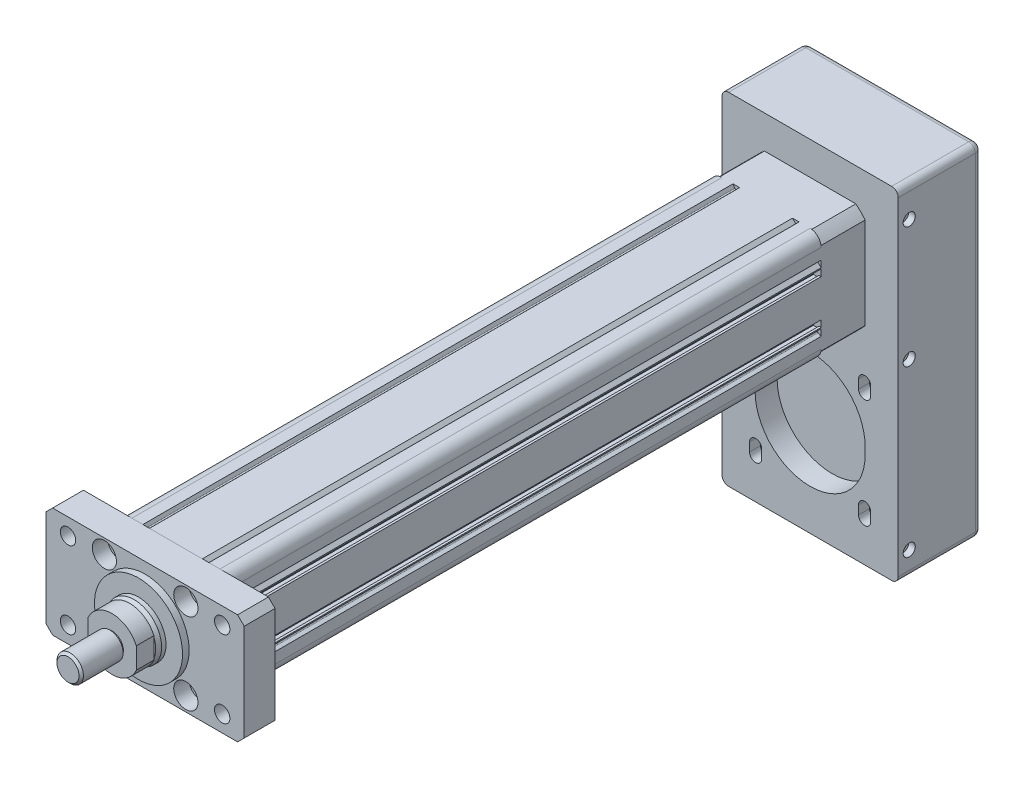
from build123d import *

# Parameters (mm, degrees)
SKETCH_1_R           = 20
SKETCH_1_R_2         = 2.75
EXTRUDE_1_DEPTH      = 268
FILLET_1_R           = 5
EXTRUDE_2_DEPTH      = 14
SKETCH_3_R           = 20
EXTRUDE_3_DEPTH      = 3
SKETCH_5_R           = 12.5
EXTRUDE_4_DEPTH      = 4
CHAMFER_1_SIZE       = 2
CHAMFER_1_SIZE2      = 0.7
EXTRUDE_5_DEPTH      = 8
SKETCH_7_R           = 5.15
EXTRUDE_6_DEPTH      = 1
SKETCH_8_R           = 6
EXTRUDE_7_DEPTH      = 19
CHAMFER_2_SIZE       = 1
SKETCH_23_W          = 50
SKETCH_23_H          = 50
EXTRUDE_8_DEPTH      = 20
SKETCH_24_R          = 42.5
SKETCH_24_R_2        = 32.5
CUT_EXTRUDE_1_DEPTH  = 20
SKETCH_4_R           = 3.5
CUT_EXTRUDE_5_DEPTH  = 30
SKETCH_4_6_R         = 5.5
CUT_EXTRUDE_6_DEPTH  = 7
SKETCH_35_W          = 80
SKETCH_35_H          = 155
EXTRUDE_10_DEPTH     = 38
CUT_EXTRUDE_11_DEPTH = 10
CUT_EXTRUDE_12_DEPTH = 10
CUT_EXTRUDE_START    = 10
CUT_EXTRUDE_13_DEPTH = 5
FILLET_2_R           = 3
SKETCH_37_R          = 2.75
CUT_EXTRUDE_14_DEPTH = 3
CUT_EXTRUDE_START_2  = -3
SKETCH_38_R          = 2.75
CUT_EXTRUDE_15_DEPTH = 3
FILLET_3_R           = 3


with BuildPart() as part:
    # Sketch 1 → Extrude 1 (new body)
    with BuildSketch(Plane.XY):
        with BuildLine():
            Line((-25, 25), (-15, 25))
            Line((-15, 25), (-14.227730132, 23.662389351))
            ThreePointArc((-14.227730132, 23.662389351), (-13.859980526, 23.416666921), (-13.441164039, 23.558835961))
            Line((-13.441164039, 23.558835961), (-12, 25))
            Line((-12, 25), (12, 25))
            Line((12, 25), (13.441164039, 23.558835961))
            ThreePointArc((13.441164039, 23.558835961), (13.859980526, 23.416666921), (14.227730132, 23.662389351))
            Line((14.227730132, 23.662389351), (15, 25))
            Line((15, 25), (25, 25))
            Line((25, 25), (25, 15))
            Line((25, 15), (23.662389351, 14.227730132))
            ThreePointArc((23.662389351, 14.227730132), (23.416666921, 13.859980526), (23.558835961, 13.441164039))
            Line((23.558835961, 13.441164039), (25, 12))
            Line((25, 12), (25, 11.5))
            Line((25, 11.5), (24, 11.5))
            Line((24, 11.5), (24, 12.4))
            Line((24, 12.4), (21.5, 12.4))
            Line((21.5, 12.4), (21.5, 7.6))
            Line((21.5, 7.6), (24, 7.6))
            Line((24, 7.6), (24, 8.5))
            Line((24, 8.5), (25, 8.5))
            Line((25, 8.5), (25, -8.5))
            Line((25, -8.5), (24, -8.5))
            Line((24, -8.5), (24, -7.6))
            Line((24, -7.6), (21.5, -7.6))
            Line((21.5, -7.6), (21.5, -12.4))
            Line((21.5, -12.4), (24, -12.4))
            Line((24, -12.4), (24, -11.5))
            Line((24, -11.5), (25, -11.5))
            Line((25, -11.5), (25, -12))
            Line((25, -12), (23.558835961, -13.441164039))
            ThreePointArc((23.558835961, -13.441164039), (23.416666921, -13.859980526), (23.662389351, -14.227730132))
            Line((23.662389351, -14.227730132), (25, -15))
            Line((25, -15), (25, -25))
            Line((25, -25), (15, -25))
            Line((15, -25), (14.227730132, -23.662389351))
            ThreePointArc((14.227730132, -23.662389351), (13.859980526, -23.416666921), (13.441164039, -23.558835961))
            Line((13.441164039, -23.558835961), (12, -25))
            Line((12, -25), (11.5, -25))
            Line((11.5, -25), (11.5, -24))
            Line((11.5, -24), (12.4, -24))
            Line((12.4, -24), (12.4, -21.5))
            Line((12.4, -21.5), (7.6, -21.5))
            Line((7.6, -21.5), (7.6, -24))
            Line((7.6, -24), (8.5, -24))
            Line((8.5, -24), (8.5, -25))
            Line((8.5, -25), (-8.5, -25))
            Line((-8.5, -25), (-8.5, -24))
            Line((-8.5, -24), (-7.6, -24))
            Line((-7.6, -24), (-7.6, -21.5))
            Line((-7.6, -21.5), (-12.4, -21.5))
            Line((-12.4, -21.5), (-12.4, -24))
            Line((-12.4, -24), (-11.5, -24))
            Line((-11.5, -24), (-11.5, -25))
            Line((-11.5, -25), (-12, -25))
            Line((-12, -25), (-13.441164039, -23.558835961))
            ThreePointArc((-13.441164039, -23.558835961), (-13.859980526, -23.416666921), (-14.227730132, -23.662389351))
            Line((-14.227730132, -23.662389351), (-15, -25))
            Line((-15, -25), (-25, -25))
            Line((-25, -25), (-25, -15))
            Line((-25, -15), (-23.662389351, -14.227730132))
            ThreePointArc((-23.662389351, -14.227730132), (-23.416666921, -13.859980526), (-23.558835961, -13.441164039))
            Line((-23.558835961, -13.441164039), (-25, -12))
            Line((-25, -12), (-25, -11.5))
            Line((-25, -11.5), (-24, -11.5))
            Line((-24, -11.5), (-24, -12.4))
            Line((-24, -12.4), (-21.5, -12.4))
            Line((-21.5, -12.4), (-21.5, -7.6))
            Line((-21.5, -7.6), (-24, -7.6))
            Line((-24, -7.6), (-24, -8.5))
            Line((-24, -8.5), (-25, -8.5))
            Line((-25, -8.5), (-25, 8.5))
            Line((-25, 8.5), (-24, 8.5))
            Line((-24, 8.5), (-24, 7.6))
            Line((-24, 7.6), (-21.5, 7.6))
            Line((-21.5, 7.6), (-21.5, 12.4))
            Line((-21.5, 12.4), (-24, 12.4))
            Line((-24, 12.4), (-24, 11.5))
            Line((-24, 11.5), (-25, 11.5))
            Line((-25, 11.5), (-25, 12))
            Line((-25, 12), (-23.558835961, 13.441164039))
            ThreePointArc((-23.558835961, 13.441164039), (-23.416666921, 13.859980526), (-23.662389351, 14.227730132))
            Line((-23.662389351, 14.227730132), (-25, 15))
            Line((-25, 15), (-25, 25))
        make_face()
        Circle(SKETCH_1_R, mode=Mode.SUBTRACT)
        with Locations((-18.5, 18.5)):
            Circle(SKETCH_1_R_2, mode=Mode.SUBTRACT)
        with Locations((18.5, 18.5)):
            Circle(SKETCH_1_R_2, mode=Mode.SUBTRACT)
        with Locations((18.5, -18.5)):
            Circle(SKETCH_1_R_2, mode=Mode.SUBTRACT)
        with Locations((-18.5, -18.5)):
            Circle(SKETCH_1_R_2, mode=Mode.SUBTRACT)
        with BuildLine():
            Line((-13.868836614, 23), (-5, 23))
            ThreePointArc((-5, 23), (-4.502985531, 22.554558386), (-4.891534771, 22.01190647))
            ThreePointArc((-4.891534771, 22.01190647), (-10.498377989, 19.955831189), (-15.368836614, 16.5))
            Line((-15.368836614, 16.5), (-15.368836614, 21.5))
            Line((-15.368836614, 21.5), (-13.868836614, 23))
        make_face(mode=Mode.SUBTRACT)
        with BuildLine():
            Line((15.368836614, 16.5), (15.368836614, 21.5))
            Line((15.368836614, 21.5), (13.868836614, 23))
            Line((13.868836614, 23), (5, 23))
            ThreePointArc((5, 23), (4.502985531, 22.554558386), (4.891534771, 22.01190647))
            ThreePointArc((4.891534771, 22.01190647), (10.498377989, 19.955831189), (15.368836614, 16.5))
        make_face(mode=Mode.SUBTRACT)
    extrude(amount=EXTRUDE_1_DEPTH)

    # Fillet 1
    fillet_1_edges = [part.edges().sort_by_distance(p)[0] for p in [
        (-25, 25, 134),
        (25, 25, 134),
        (25, -25, 134),
        (-25, -25, 134),
    ]]
    fillet(fillet_1_edges, radius=FILLET_1_R)

    # Sketch 23 → Extrude 8 (add)
    with BuildSketch(Plane(origin=(0, 0, 0), x_dir=(-1, 0, 0), z_dir=(0, 0, -1))):
        Rectangle(SKETCH_23_W, SKETCH_23_H)
    extrude(amount=EXTRUDE_8_DEPTH)

    # Sketch 24 → Cut-Extrude 1 (cut)
    with BuildSketch(Plane(origin=(0, 0, -20), x_dir=(-1, 0, 0), z_dir=(0, 0, -1))):
        Circle(SKETCH_24_R)
        Circle(SKETCH_24_R_2, mode=Mode.SUBTRACT)
    extrude(amount=-CUT_EXTRUDE_1_DEPTH, mode=Mode.SUBTRACT)

    # Sketch 27 → Hole Wizard M6 _1 (revolve, cut)
    with BuildSketch(Plane(origin=(0, -25, -12), x_dir=(0, 0, -1), z_dir=(1, 0, 0))):
        Polygon((0, 0), (0, 8.502151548), (2.5, 7), (2.5, 0), align=None)
    revolve(axis=Axis((0, -31.35, -12), (0, 1, 0)), mode=Mode.SUBTRACT)


with BuildPart() as body_2:
    # Sketch 2 → Extrude 2 (new body)
    with BuildSketch(Plane.XY.offset(268)):
        Polygon((-45, 22), (-42, 25), (42, 25), (45, 22), (45, -22), (42, -25), (-42, -25), (-45, -22), align=None)
    extrude(amount=EXTRUDE_2_DEPTH)


with BuildPart() as body_3:
    # Sketch 3 → Extrude 3 (new body)
    with BuildSketch(Plane.XY.offset(282)):
        Circle(SKETCH_3_R)
    extrude(amount=EXTRUDE_3_DEPTH)


with BuildPart() as body_4:
    # Sketch 5 → Extrude 4 (new body)
    with BuildSketch(Plane.XY.offset(285)):
        Circle(SKETCH_5_R)
    extrude(amount=EXTRUDE_4_DEPTH)

    # Chamfer 1
    chamfer_1_edges = [body_4.edges().sort_by_distance(p)[0] for p in [
        (-12.5, 0, 289),
    ]]
    chamfer_1_side = [body_4.faces().sort_by_distance(p)[0] for p in [
        (-12.5, 0, 287),
    ]]
    chamfer(chamfer_1_edges, length=CHAMFER_1_SIZE, length2=CHAMFER_1_SIZE2, reference=chamfer_1_side[0])


with BuildPart() as body_5:
    # Sketch 6 → Extrude 5 (new body)
    with BuildSketch(Plane.XY.offset(289)):
        with BuildLine():
            Line((-11, 4.795831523), (-11, -4.795831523))
            ThreePointArc((-11, -4.795831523), (0, -12), (11, -4.795831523))
            Line((11, -4.795831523), (11, 4.795831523))
            ThreePointArc((11, 4.795831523), (0, 12), (-11, 4.795831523))
        make_face()
    extrude(amount=EXTRUDE_5_DEPTH)


with BuildPart() as body_6:
    # Sketch 7 → Extrude 6 (new body)
    with BuildSketch(Plane.XY.offset(297)):
        Circle(SKETCH_7_R)
    extrude(amount=EXTRUDE_6_DEPTH)


with BuildPart() as body_7:
    # Sketch 8 → Extrude 7 (new body)
    with BuildSketch(Plane.XY.offset(298)):
        Circle(SKETCH_8_R)
    extrude(amount=EXTRUDE_7_DEPTH)

    # Chamfer 2
    chamfer_2_edges = [body_7.edges().sort_by_distance(p)[0] for p in [
        (-6, 0, 317),
    ]]
    chamfer(chamfer_2_edges, length=CHAMFER_2_SIZE)


with BuildPart() as cut_extrude_5_tool:
    # Sketch 4 → Cut-Extrude 5 (new body)
    with BuildSketch(Plane.XY.offset(282)):
        with Locations((-35, 17.5)):
            Circle(SKETCH_4_R)
        with Locations((-18.5, 18.5)):
            Circle(SKETCH_4_R)
        with Locations(Location((-18.5, -18.5, 0), (0, 0, 180))):
            Circle(SKETCH_4_R)
        with Locations(Location((-35, -17.5, 0), (0, 0, 180))):
            Circle(SKETCH_4_R)
        with Locations((35, -17.5)):
            Circle(SKETCH_4_R)
        with Locations((18.5, -18.5)):
            Circle(SKETCH_4_R)
        with Locations(Location((18.5, 18.5, 0), (0, 0, 180))):
            Circle(SKETCH_4_R)
        with Locations(Location((35, 17.5, 0), (0, 0, 180))):
            Circle(SKETCH_4_R)
    extrude(amount=-CUT_EXTRUDE_5_DEPTH)


with BuildPart() as part_1:
    add(part.part)

    # Cut-Extrude 5: cut by cut_extrude_5_tool
    add(cut_extrude_5_tool.part, mode=Mode.SUBTRACT)

    # Sketch 35 → Extrude 10 (add)
    with BuildSketch(Plane(origin=(0, 0, -20), x_dir=(-1, 0, 0), z_dir=(0, 0, -1))):
        with Locations((0, -37.5)):
            Rectangle(SKETCH_35_W, SKETCH_35_H)
    extrude(amount=EXTRUDE_10_DEPTH)

    # Sketch 35_3 → Cut-Extrude 11 (cut)
    with BuildSketch(Plane(origin=(0, 0, -20), x_dir=(-1, 0, 0), z_dir=(0, 0, -1))):
        with BuildLine():
            Line((25, -68.5), (25, -71.5))
            ThreePointArc((25, -71.5), (-0.002360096, -96.499999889), (-24.999999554, -71.495279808))
            Line((-24.999999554, -71.495279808), (-24.999464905, -68.663567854))
            ThreePointArc((-24.999464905, -68.663567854), (-0.081784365, -43.500133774), (25, -68.5))
        make_face()
    extrude(amount=CUT_EXTRUDE_11_DEPTH, mode=Mode.SUBTRACT)

    # Sketch 35_4 → Cut-Extrude 12 (cut)
    with BuildSketch(Plane(origin=(0, 0, -20), x_dir=(-1, 0, 0), z_dir=(0, 0, -1))):
        with BuildLine():
            Line((27.498737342, -92.748737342), (27.498737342, -96.748737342))
            ThreePointArc((27.498737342, -96.748737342), (24.748737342, -99.498737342), (21.998737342, -96.748737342))
            Line((21.998737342, -96.748737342), (21.998737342, -92.748737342))
            ThreePointArc((21.998737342, -92.748737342), (24.748737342, -89.998737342), (27.498737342, -92.748737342))
        make_face()
        with BuildLine():
            Line((-27.498737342, -92.748737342), (-27.498737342, -96.748737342))
            ThreePointArc((-27.498737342, -96.748737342), (-24.748737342, -99.498737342), (-21.998737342, -96.748737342))
            Line((-21.998737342, -96.748737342), (-21.998737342, -92.748737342))
            ThreePointArc((-21.998737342, -92.748737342), (-24.748737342, -89.998737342), (-27.498737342, -92.748737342))
        make_face()
        with BuildLine():
            Line((-27.498737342, -47.251262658), (-27.498737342, -43.251262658))
            ThreePointArc((-27.498737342, -43.251262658), (-24.748737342, -40.501262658), (-21.998737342, -43.251262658))
            Line((-21.998737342, -43.251262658), (-21.998737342, -47.251262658))
            ThreePointArc((-21.998737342, -47.251262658), (-24.748737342, -50.001262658), (-27.498737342, -47.251262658))
        make_face()
        with BuildLine():
            Line((27.498737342, -47.251262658), (27.498737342, -43.251262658))
            ThreePointArc((27.498737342, -43.251262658), (24.748737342, -40.501262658), (21.998737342, -43.251262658))
            Line((21.998737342, -43.251262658), (21.998737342, -47.251262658))
            ThreePointArc((21.998737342, -47.251262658), (24.748737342, -50.001262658), (27.498737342, -47.251262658))
        make_face()
    extrude(amount=CUT_EXTRUDE_12_DEPTH, mode=Mode.SUBTRACT)

    # Sketch 35_5 → Cut-Extrude 13 (cut)
    with BuildSketch(Plane(origin=(0, 0, -20), x_dir=(-1, 0, 0), z_dir=(0, 0, -1)).offset(CUT_EXTRUDE_START)):
        with BuildLine():
            Line((28.848737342, -91.848737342), (28.848737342, -97.648737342))
            ThreePointArc((28.848737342, -97.648737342), (24.748737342, -101.748737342), (20.648737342, -97.648737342))
            Line((20.648737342, -97.648737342), (20.648737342, -91.848737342))
            ThreePointArc((20.648737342, -91.848737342), (24.748737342, -87.748737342), (28.848737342, -91.848737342))
        make_face()
        with BuildLine():
            Line((-28.848737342, -91.848737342), (-28.848737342, -97.648737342))
            ThreePointArc((-28.848737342, -97.648737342), (-24.748737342, -101.748737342), (-20.648737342, -97.648737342))
            Line((-20.648737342, -97.648737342), (-20.648737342, -91.848737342))
            ThreePointArc((-20.648737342, -91.848737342), (-24.748737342, -87.748737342), (-28.848737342, -91.848737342))
        make_face()
        with BuildLine():
            Line((-28.848737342, -48.151262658), (-28.848737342, -42.351262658))
            ThreePointArc((-28.848737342, -42.351262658), (-24.748737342, -38.251262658), (-20.648737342, -42.351262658))
            Line((-20.648737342, -42.351262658), (-20.648737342, -48.151262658))
            ThreePointArc((-20.648737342, -48.151262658), (-24.748737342, -52.251262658), (-28.848737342, -48.151262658))
        make_face()
        with BuildLine():
            Line((28.848737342, -48.151262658), (28.848737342, -42.351262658))
            ThreePointArc((28.848737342, -42.351262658), (24.748737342, -38.251262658), (20.648737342, -42.351262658))
            Line((20.648737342, -42.351262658), (20.648737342, -48.151262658))
            ThreePointArc((20.648737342, -48.151262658), (24.748737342, -52.251262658), (28.848737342, -48.151262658))
        make_face()
    extrude(amount=-CUT_EXTRUDE_13_DEPTH, mode=Mode.SUBTRACT)

    # Fillet 2
    fillet_2_edges = [part_1.edges().sort_by_distance(p)[0] for p in [
        (40, -115, -39),
        (-40, -115, -39),
        (-40, 40, -39),
        (40, 40, -39),
    ]]
    fillet(fillet_2_edges, radius=FILLET_2_R)

    # Sketch 37 → Cut-Extrude 14 (cut)
    with BuildSketch(Plane(origin=(40, 0, 0), x_dir=(0, 0, -1), z_dir=(1, 0, 0))):
        with Locations((25, -104)):
            Circle(SKETCH_37_R)
        with Locations((25, -29)):
            Circle(SKETCH_37_R)
        with Locations((25, 26)):
            Circle(SKETCH_37_R)
    extrude(amount=-CUT_EXTRUDE_14_DEPTH, mode=Mode.SUBTRACT)

    # Sketch 38 → Cut-Extrude 15 (cut)
    with BuildSketch(Plane.ZY.offset(40).offset(CUT_EXTRUDE_START_2)):
        with Locations(Location((-25, 26, 0), (0, 0, 180))):
            Circle(SKETCH_38_R)
        with Locations(Location((-25, -29, 0), (0, 0, 180))):
            Circle(SKETCH_38_R)
        with Locations(Location((-25, -104, 0), (0, 0, 180))):
            Circle(SKETCH_38_R)
    extrude(amount=CUT_EXTRUDE_15_DEPTH, mode=Mode.SUBTRACT)

    # Fillet 3
    fillet_3_edges = [part_1.edges().sort_by_distance(p)[0] for p in [
        (-40, -37.5, -58),
        (0, -115, -58),
        (0, 40, -58),
        (40, -37.5, -58),
        (39.121320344, -114.121320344, -58),
        (39.121320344, 39.121320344, -58),
        (-39.121320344, 39.121320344, -58),
        (-39.121320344, -114.121320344, -58),
    ]]
    fillet(fillet_3_edges, radius=FILLET_3_R)


with BuildPart() as body_2_1:
    add(body_2.part)

    # Cut-Extrude 5: cut by cut_extrude_5_tool
    add(cut_extrude_5_tool.part, mode=Mode.SUBTRACT)

    # Sketch 4_6 → Cut-Extrude 6 (cut)
    with BuildSketch(Plane.XY.offset(282)):
        with Locations((-18.5, 18.5)):
            Circle(SKETCH_4_6_R)
        with Locations(Location((-18.5, -18.5, 0), (0, 0, 180))):
            Circle(SKETCH_4_6_R)
        with Locations((18.5, -18.5)):
            Circle(SKETCH_4_6_R)
        with Locations(Location((18.5, 18.5, 0), (0, 0, 180))):
            Circle(SKETCH_4_6_R)
    extrude(amount=-CUT_EXTRUDE_6_DEPTH, mode=Mode.SUBTRACT)


solid = Compound([body_3.part, body_4.part, body_5.part, body_6.part, body_7.part, part_1.part, body_2_1.part])
